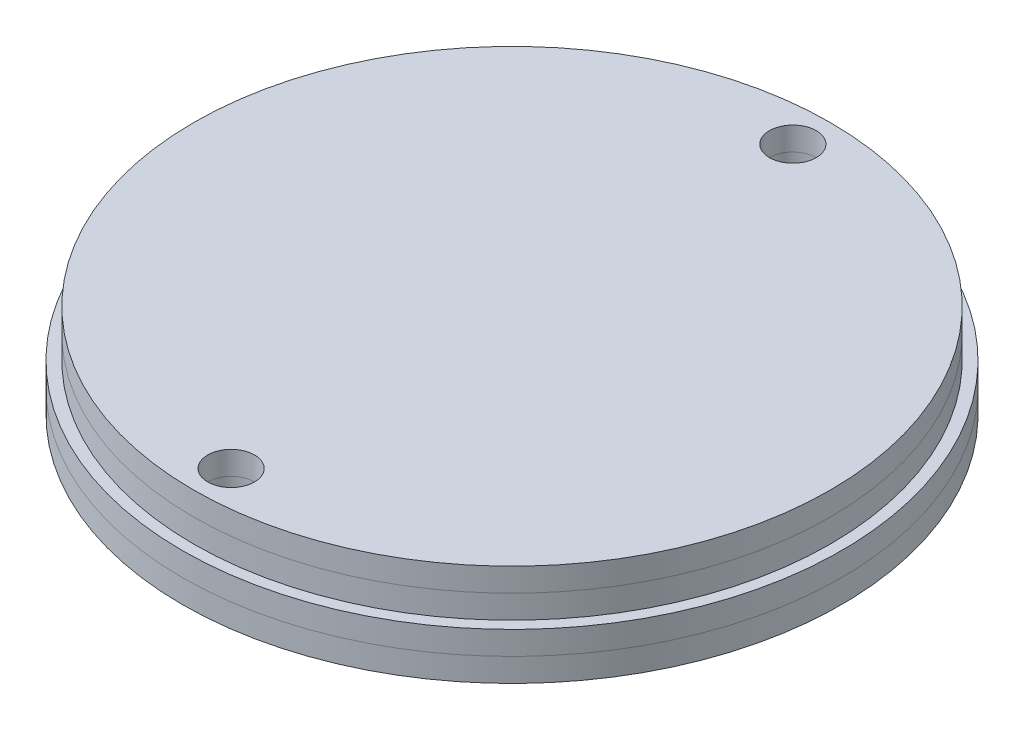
ISO-10303-21;
HEADER;
FILE_DESCRIPTION(('STEP AP214'),'2;1');
FILE_NAME('part.step','',(''),(''),'','','');
FILE_SCHEMA(('AUTOMOTIVE_DESIGN { 1 0 10303 214 1 1 1 1 }'));
ENDSEC;
DATA;
#1=APPLICATION_CONTEXT('core data for automotive mechanical design processes');
#2=APPLICATION_PROTOCOL_DEFINITION('international standard','automotive_design',2000,#1);
#3=PRODUCT_CONTEXT('',#1,'mechanical');
#4=PRODUCT('Part','Part','',(#3));
#5=PRODUCT_RELATED_PRODUCT_CATEGORY('part','',(#4));
#6=PRODUCT_DEFINITION_FORMATION('','',#4);
#7=PRODUCT_DEFINITION_CONTEXT('part definition',#1,'design');
#8=PRODUCT_DEFINITION('design','',#6,#7);
#9=PRODUCT_DEFINITION_SHAPE('','',#8);
#10=(LENGTH_UNIT() NAMED_UNIT(*) SI_UNIT(.MILLI.,.METRE.));
#11=(NAMED_UNIT(*) PLANE_ANGLE_UNIT() SI_UNIT($,.RADIAN.));
#12=(NAMED_UNIT(*) SI_UNIT($,.STERADIAN.) SOLID_ANGLE_UNIT());
#13=UNCERTAINTY_MEASURE_WITH_UNIT(LENGTH_MEASURE(1.E-05),#10,'distance_accuracy_value','');
#14=(GEOMETRIC_REPRESENTATION_CONTEXT(3) GLOBAL_UNCERTAINTY_ASSIGNED_CONTEXT((#13)) GLOBAL_UNIT_ASSIGNED_CONTEXT((#10,
#11,#12)) REPRESENTATION_CONTEXT('',''));
#15=CARTESIAN_POINT('',(0.,0.,0.));
#16=DIRECTION('',(0.,0.,1.));
#17=DIRECTION('',(1.,0.,0.));
#18=AXIS2_PLACEMENT_3D('',#15,#16,#17);
#19=CARTESIAN_POINT('',(0.,-6.35,0.));
#20=DIRECTION('',(0.,1.,0.));
#21=DIRECTION('',(0.,0.,1.));
#22=AXIS2_PLACEMENT_3D('',#19,#20,#21);
#23=CYLINDRICAL_SURFACE('',#22,44.704);
#24=CARTESIAN_POINT('',(0.,-6.35,0.));
#25=DIRECTION('',(0.,-1.,0.));
#26=DIRECTION('',(0.,0.,-1.));
#27=AXIS2_PLACEMENT_3D('',#24,#25,#26);
#28=CIRCLE('',#27,44.704);
#29=CARTESIAN_POINT('',(0.,-6.35,-44.704));
#30=VERTEX_POINT('',#29);
#31=EDGE_CURVE('E11',#30,#30,#28,.T.);
#32=ORIENTED_EDGE('',*,*,#31,.F.);
#33=EDGE_LOOP('',(#32));
#34=FACE_BOUND('',#33,.T.);
#35=CARTESIAN_POINT('',(0.,-3.175,0.));
#36=DIRECTION('',(0.,-1.,0.));
#37=DIRECTION('',(0.,0.,-1.));
#38=AXIS2_PLACEMENT_3D('',#35,#36,#37);
#39=CIRCLE('',#38,44.704);
#40=CARTESIAN_POINT('',(0.,-3.175,-44.704));
#41=VERTEX_POINT('',#40);
#42=EDGE_CURVE('E59',#41,#41,#39,.T.);
#43=ORIENTED_EDGE('',*,*,#42,.T.);
#44=EDGE_LOOP('',(#43));
#45=FACE_BOUND('',#44,.T.);
#46=ADVANCED_FACE('F52',(#34,#45),#23,.T.);
#47=CARTESIAN_POINT('',(0.,-6.35,0.));
#48=DIRECTION('',(0.,-1.,0.));
#49=DIRECTION('',(0.,0.,-1.));
#50=AXIS2_PLACEMENT_3D('',#47,#48,#49);
#51=PLANE('',#50);
#52=CARTESIAN_POINT('',(0.,-6.35,38.1));
#53=DIRECTION('',(0.,-1.,0.));
#54=DIRECTION('',(0.,0.,-1.));
#55=AXIS2_PLACEMENT_3D('',#52,#53,#54);
#56=CIRCLE('',#55,3.175);
#57=CARTESIAN_POINT('',(0.,-6.35,34.925));
#58=VERTEX_POINT('',#57);
#59=EDGE_CURVE('E71',#58,#58,#56,.T.);
#60=ORIENTED_EDGE('',*,*,#59,.F.);
#61=EDGE_LOOP('',(#60));
#62=FACE_BOUND('',#61,.T.);
#63=CARTESIAN_POINT('',(0.,-6.35,-38.1));
#64=DIRECTION('',(0.,1.,0.));
#65=DIRECTION('',(0.,0.,1.));
#66=AXIS2_PLACEMENT_3D('',#63,#64,#65);
#67=CIRCLE('',#66,3.175);
#68=CARTESIAN_POINT('',(0.,-6.35,-34.925));
#69=VERTEX_POINT('',#68);
#70=EDGE_CURVE('E65',#69,#69,#67,.T.);
#71=ORIENTED_EDGE('',*,*,#70,.T.);
#72=EDGE_LOOP('',(#71));
#73=FACE_BOUND('',#72,.T.);
#74=ORIENTED_EDGE('',*,*,#31,.T.);
#75=EDGE_LOOP('',(#74));
#76=FACE_BOUND('',#75,.T.);
#77=ADVANCED_FACE('F78',(#62,#73,#76),#51,.T.);
#78=CARTESIAN_POINT('',(0.,-3.175,0.));
#79=DIRECTION('',(0.,-1.,0.));
#80=DIRECTION('',(0.,0.,-1.));
#81=AXIS2_PLACEMENT_3D('',#78,#79,#80);
#82=PLANE('',#81);
#83=CARTESIAN_POINT('',(0.,-3.175,38.1));
#84=DIRECTION('',(0.,1.,0.));
#85=DIRECTION('',(0.,0.,1.));
#86=AXIS2_PLACEMENT_3D('',#83,#84,#85);
#87=CIRCLE('',#86,3.175);
#88=CARTESIAN_POINT('',(0.,-3.175,41.275));
#89=VERTEX_POINT('',#88);
#90=EDGE_CURVE('E68',#89,#89,#87,.T.);
#91=ORIENTED_EDGE('',*,*,#90,.F.);
#92=EDGE_LOOP('',(#91));
#93=FACE_BOUND('',#92,.T.);
#94=CARTESIAN_POINT('',(0.,-3.175,-38.1));
#95=DIRECTION('',(0.,-1.,0.));
#96=DIRECTION('',(0.,0.,-1.));
#97=AXIS2_PLACEMENT_3D('',#94,#95,#96);
#98=CIRCLE('',#97,3.175);
#99=CARTESIAN_POINT('',(0.,-3.175,-41.275));
#100=VERTEX_POINT('',#99);
#101=EDGE_CURVE('E55',#100,#100,#98,.T.);
#102=ORIENTED_EDGE('',*,*,#101,.T.);
#103=EDGE_LOOP('',(#102));
#104=FACE_BOUND('',#103,.T.);
#105=ORIENTED_EDGE('',*,*,#42,.F.);
#106=EDGE_LOOP('',(#105));
#107=FACE_BOUND('',#106,.T.);
#108=ADVANCED_FACE('F81',(#93,#104,#107),#82,.F.);
#109=CARTESIAN_POINT('',(0.,-6.35,-38.1));
#110=DIRECTION('',(0.,1.,0.));
#111=DIRECTION('',(0.,0.,1.));
#112=AXIS2_PLACEMENT_3D('',#109,#110,#111);
#113=CYLINDRICAL_SURFACE('',#112,3.175);
#114=ORIENTED_EDGE('',*,*,#70,.F.);
#115=EDGE_LOOP('',(#114));
#116=FACE_BOUND('',#115,.T.);
#117=ORIENTED_EDGE('',*,*,#101,.F.);
#118=EDGE_LOOP('',(#117));
#119=FACE_BOUND('',#118,.T.);
#120=ADVANCED_FACE('F85',(#116,#119),#113,.F.);
#121=CARTESIAN_POINT('',(0.,-6.35,38.1));
#122=DIRECTION('',(0.,1.,0.));
#123=DIRECTION('',(0.,0.,-1.));
#124=AXIS2_PLACEMENT_3D('',#121,#122,#123);
#125=CYLINDRICAL_SURFACE('',#124,3.175);
#126=ORIENTED_EDGE('',*,*,#59,.T.);
#127=EDGE_LOOP('',(#126));
#128=FACE_BOUND('',#127,.T.);
#129=ORIENTED_EDGE('',*,*,#90,.T.);
#130=EDGE_LOOP('',(#129));
#131=FACE_BOUND('',#130,.T.);
#132=ADVANCED_FACE('F75',(#128,#131),#125,.F.);
#133=CLOSED_SHELL('',(#46,#77,#108,#120,#132));
#134=MANIFOLD_SOLID_BREP('B2',#133);
#135=CARTESIAN_POINT('',(0.,6.35,0.));
#136=DIRECTION('',(0.,-1.,0.));
#137=DIRECTION('',(0.,0.,-1.));
#138=AXIS2_PLACEMENT_3D('',#135,#136,#137);
#139=CYLINDRICAL_SURFACE('',#138,43.18);
#140=CARTESIAN_POINT('',(0.,6.35,0.));
#141=DIRECTION('',(0.,1.,0.));
#142=DIRECTION('',(0.,0.,1.));
#143=AXIS2_PLACEMENT_3D('',#140,#141,#142);
#144=CIRCLE('',#143,43.18);
#145=CARTESIAN_POINT('',(0.,6.35,43.18));
#146=VERTEX_POINT('',#145);
#147=EDGE_CURVE('E51',#146,#146,#144,.T.);
#148=ORIENTED_EDGE('',*,*,#147,.F.);
#149=EDGE_LOOP('',(#148));
#150=FACE_BOUND('',#149,.T.);
#151=CARTESIAN_POINT('',(0.,3.175,0.));
#152=DIRECTION('',(0.,1.,0.));
#153=DIRECTION('',(0.,0.,1.));
#154=AXIS2_PLACEMENT_3D('',#151,#152,#153);
#155=CIRCLE('',#154,43.18);
#156=CARTESIAN_POINT('',(0.,3.175,43.18));
#157=VERTEX_POINT('',#156);
#158=EDGE_CURVE('E159',#157,#157,#155,.T.);
#159=ORIENTED_EDGE('',*,*,#158,.T.);
#160=EDGE_LOOP('',(#159));
#161=FACE_BOUND('',#160,.T.);
#162=ADVANCED_FACE('F152',(#150,#161),#139,.T.);
#163=CARTESIAN_POINT('',(0.,6.35,0.));
#164=DIRECTION('',(0.,1.,0.));
#165=DIRECTION('',(0.,0.,1.));
#166=AXIS2_PLACEMENT_3D('',#163,#164,#165);
#167=PLANE('',#166);
#168=CARTESIAN_POINT('',(0.,6.35,38.1));
#169=DIRECTION('',(0.,-1.,0.));
#170=DIRECTION('',(0.,0.,-1.));
#171=AXIS2_PLACEMENT_3D('',#168,#169,#170);
#172=CIRCLE('',#171,3.175);
#173=CARTESIAN_POINT('',(0.,6.35,34.925));
#174=VERTEX_POINT('',#173);
#175=EDGE_CURVE('E171',#174,#174,#172,.T.);
#176=ORIENTED_EDGE('',*,*,#175,.T.);
#177=EDGE_LOOP('',(#176));
#178=FACE_BOUND('',#177,.T.);
#179=CARTESIAN_POINT('',(0.,6.35,-38.1));
#180=DIRECTION('',(0.,1.,0.));
#181=DIRECTION('',(0.,0.,1.));
#182=AXIS2_PLACEMENT_3D('',#179,#180,#181);
#183=CIRCLE('',#182,3.175);
#184=CARTESIAN_POINT('',(0.,6.35,-34.925));
#185=VERTEX_POINT('',#184);
#186=EDGE_CURVE('E165',#185,#185,#183,.T.);
#187=ORIENTED_EDGE('',*,*,#186,.F.);
#188=EDGE_LOOP('',(#187));
#189=FACE_BOUND('',#188,.T.);
#190=ORIENTED_EDGE('',*,*,#147,.T.);
#191=EDGE_LOOP('',(#190));
#192=FACE_BOUND('',#191,.T.);
#193=ADVANCED_FACE('F175',(#178,#189,#192),#167,.T.);
#194=CARTESIAN_POINT('',(0.,3.175,0.));
#195=DIRECTION('',(0.,1.,0.));
#196=DIRECTION('',(0.,0.,1.));
#197=AXIS2_PLACEMENT_3D('',#194,#195,#196);
#198=PLANE('',#197);
#199=CARTESIAN_POINT('',(0.,3.175,38.1));
#200=DIRECTION('',(0.,-1.,0.));
#201=DIRECTION('',(0.,0.,-1.));
#202=AXIS2_PLACEMENT_3D('',#199,#200,#201);
#203=CIRCLE('',#202,3.175);
#204=CARTESIAN_POINT('',(0.,3.175,34.925));
#205=VERTEX_POINT('',#204);
#206=EDGE_CURVE('E168',#205,#205,#203,.T.);
#207=ORIENTED_EDGE('',*,*,#206,.F.);
#208=EDGE_LOOP('',(#207));
#209=FACE_BOUND('',#208,.T.);
#210=CARTESIAN_POINT('',(0.,3.175,-38.1));
#211=DIRECTION('',(0.,1.,0.));
#212=DIRECTION('',(0.,0.,1.));
#213=AXIS2_PLACEMENT_3D('',#210,#211,#212);
#214=CIRCLE('',#213,3.175);
#215=CARTESIAN_POINT('',(0.,3.175,-34.925));
#216=VERTEX_POINT('',#215);
#217=EDGE_CURVE('E155',#216,#216,#214,.T.);
#218=ORIENTED_EDGE('',*,*,#217,.T.);
#219=EDGE_LOOP('',(#218));
#220=FACE_BOUND('',#219,.T.);
#221=ORIENTED_EDGE('',*,*,#158,.F.);
#222=EDGE_LOOP('',(#221));
#223=FACE_BOUND('',#222,.T.);
#224=ADVANCED_FACE('F185',(#209,#220,#223),#198,.F.);
#225=CARTESIAN_POINT('',(0.,-6.35,-38.1));
#226=DIRECTION('',(0.,1.,0.));
#227=DIRECTION('',(0.,0.,1.));
#228=AXIS2_PLACEMENT_3D('',#225,#226,#227);
#229=CYLINDRICAL_SURFACE('',#228,3.175);
#230=ORIENTED_EDGE('',*,*,#186,.T.);
#231=EDGE_LOOP('',(#230));
#232=FACE_BOUND('',#231,.T.);
#233=ORIENTED_EDGE('',*,*,#217,.F.);
#234=EDGE_LOOP('',(#233));
#235=FACE_BOUND('',#234,.T.);
#236=ADVANCED_FACE('F181',(#232,#235),#229,.F.);
#237=CARTESIAN_POINT('',(0.,-6.35,38.1));
#238=DIRECTION('',(0.,1.,0.));
#239=DIRECTION('',(0.,0.,-1.));
#240=AXIS2_PLACEMENT_3D('',#237,#238,#239);
#241=CYLINDRICAL_SURFACE('',#240,3.175);
#242=ORIENTED_EDGE('',*,*,#175,.F.);
#243=EDGE_LOOP('',(#242));
#244=FACE_BOUND('',#243,.T.);
#245=ORIENTED_EDGE('',*,*,#206,.T.);
#246=EDGE_LOOP('',(#245));
#247=FACE_BOUND('',#246,.T.);
#248=ADVANCED_FACE('F178',(#244,#247),#241,.F.);
#249=CLOSED_SHELL('',(#162,#193,#224,#236,#248));
#250=MANIFOLD_SOLID_BREP('B6',#249);
#251=CARTESIAN_POINT('',(0.,3.175,0.));
#252=DIRECTION('',(0.,-1.,0.));
#253=DIRECTION('',(0.,0.,-1.));
#254=AXIS2_PLACEMENT_3D('',#251,#252,#253);
#255=CYLINDRICAL_SURFACE('',#254,43.18);
#256=CARTESIAN_POINT('',(0.,3.175,0.));
#257=DIRECTION('',(0.,1.,0.));
#258=DIRECTION('',(0.,0.,1.));
#259=AXIS2_PLACEMENT_3D('',#256,#257,#258);
#260=CIRCLE('',#259,43.18);
#261=CARTESIAN_POINT('',(0.,3.175,43.18));
#262=VERTEX_POINT('',#261);
#263=EDGE_CURVE('E151',#262,#262,#260,.T.);
#264=ORIENTED_EDGE('',*,*,#263,.F.);
#265=EDGE_LOOP('',(#264));
#266=FACE_BOUND('',#265,.T.);
#267=CARTESIAN_POINT('',(0.,0.,0.));
#268=DIRECTION('',(0.,1.,0.));
#269=DIRECTION('',(0.,0.,1.));
#270=AXIS2_PLACEMENT_3D('',#267,#268,#269);
#271=CIRCLE('',#270,43.18);
#272=CARTESIAN_POINT('',(0.,0.,43.18));
#273=VERTEX_POINT('',#272);
#274=EDGE_CURVE('E253',#273,#273,#271,.T.);
#275=ORIENTED_EDGE('',*,*,#274,.T.);
#276=EDGE_LOOP('',(#275));
#277=FACE_BOUND('',#276,.T.);
#278=ADVANCED_FACE('F245',(#266,#277),#255,.T.);
#279=CARTESIAN_POINT('',(0.,3.175,0.));
#280=DIRECTION('',(0.,1.,0.));
#281=DIRECTION('',(0.,0.,1.));
#282=AXIS2_PLACEMENT_3D('',#279,#280,#281);
#283=PLANE('',#282);
#284=CARTESIAN_POINT('',(0.,3.175,38.1));
#285=DIRECTION('',(0.,-1.,0.));
#286=DIRECTION('',(0.,0.,-1.));
#287=AXIS2_PLACEMENT_3D('',#284,#285,#286);
#288=CIRCLE('',#287,3.175);
#289=CARTESIAN_POINT('',(0.,3.175,34.925));
#290=VERTEX_POINT('',#289);
#291=EDGE_CURVE('E276',#290,#290,#288,.T.);
#292=ORIENTED_EDGE('',*,*,#291,.T.);
#293=EDGE_LOOP('',(#292));
#294=FACE_BOUND('',#293,.T.);
#295=CARTESIAN_POINT('',(0.,3.175,-38.1));
#296=DIRECTION('',(0.,1.,0.));
#297=DIRECTION('',(0.,0.,1.));
#298=AXIS2_PLACEMENT_3D('',#295,#296,#297);
#299=CIRCLE('',#298,3.175);
#300=CARTESIAN_POINT('',(0.,3.175,-34.925));
#301=VERTEX_POINT('',#300);
#302=EDGE_CURVE('E265',#301,#301,#299,.T.);
#303=ORIENTED_EDGE('',*,*,#302,.F.);
#304=EDGE_LOOP('',(#303));
#305=FACE_BOUND('',#304,.T.);
#306=ORIENTED_EDGE('',*,*,#263,.T.);
#307=EDGE_LOOP('',(#306));
#308=FACE_BOUND('',#307,.T.);
#309=ADVANCED_FACE('F281',(#294,#305,#308),#283,.T.);
#310=CARTESIAN_POINT('',(0.,-3.175,0.));
#311=DIRECTION('',(0.,1.,0.));
#312=DIRECTION('',(0.,0.,1.));
#313=AXIS2_PLACEMENT_3D('',#310,#311,#312);
#314=CYLINDRICAL_SURFACE('',#313,44.704);
#315=CARTESIAN_POINT('',(0.,-3.175,0.));
#316=DIRECTION('',(0.,1.,0.));
#317=DIRECTION('',(0.,0.,1.));
#318=AXIS2_PLACEMENT_3D('',#315,#316,#317);
#319=CIRCLE('',#318,44.704);
#320=CARTESIAN_POINT('',(0.,-3.175,44.704));
#321=VERTEX_POINT('',#320);
#322=EDGE_CURVE('E259',#321,#321,#319,.T.);
#323=ORIENTED_EDGE('',*,*,#322,.T.);
#324=EDGE_LOOP('',(#323));
#325=FACE_BOUND('',#324,.T.);
#326=CARTESIAN_POINT('',(0.,0.,0.));
#327=DIRECTION('',(0.,1.,0.));
#328=DIRECTION('',(0.,0.,1.));
#329=AXIS2_PLACEMENT_3D('',#326,#327,#328);
#330=CIRCLE('',#329,44.704);
#331=CARTESIAN_POINT('',(0.,0.,44.704));
#332=VERTEX_POINT('',#331);
#333=EDGE_CURVE('E261',#332,#332,#330,.T.);
#334=ORIENTED_EDGE('',*,*,#333,.F.);
#335=EDGE_LOOP('',(#334));
#336=FACE_BOUND('',#335,.T.);
#337=ADVANCED_FACE('F295',(#325,#336),#314,.T.);
#338=CARTESIAN_POINT('',(0.,-3.175,0.));
#339=DIRECTION('',(0.,1.,0.));
#340=DIRECTION('',(0.,0.,1.));
#341=AXIS2_PLACEMENT_3D('',#338,#339,#340);
#342=PLANE('',#341);
#343=CARTESIAN_POINT('',(0.,-3.175,38.1));
#344=DIRECTION('',(0.,-1.,0.));
#345=DIRECTION('',(0.,0.,-1.));
#346=AXIS2_PLACEMENT_3D('',#343,#344,#345);
#347=CIRCLE('',#346,3.175);
#348=CARTESIAN_POINT('',(0.,-3.175,34.925));
#349=VERTEX_POINT('',#348);
#350=EDGE_CURVE('E272',#349,#349,#347,.T.);
#351=ORIENTED_EDGE('',*,*,#350,.F.);
#352=EDGE_LOOP('',(#351));
#353=FACE_BOUND('',#352,.T.);
#354=CARTESIAN_POINT('',(0.,-3.175,-38.1));
#355=DIRECTION('',(0.,1.,0.));
#356=DIRECTION('',(0.,0.,1.));
#357=AXIS2_PLACEMENT_3D('',#354,#355,#356);
#358=CIRCLE('',#357,3.175);
#359=CARTESIAN_POINT('',(0.,-3.175,-34.925));
#360=VERTEX_POINT('',#359);
#361=EDGE_CURVE('E248',#360,#360,#358,.T.);
#362=ORIENTED_EDGE('',*,*,#361,.T.);
#363=EDGE_LOOP('',(#362));
#364=FACE_BOUND('',#363,.T.);
#365=ORIENTED_EDGE('',*,*,#322,.F.);
#366=EDGE_LOOP('',(#365));
#367=FACE_BOUND('',#366,.T.);
#368=ADVANCED_FACE('F291',(#353,#364,#367),#342,.F.);
#369=CARTESIAN_POINT('',(0.,0.,0.));
#370=DIRECTION('',(0.,1.,0.));
#371=DIRECTION('',(0.,0.,1.));
#372=AXIS2_PLACEMENT_3D('',#369,#370,#371);
#373=PLANE('',#372);
#374=ORIENTED_EDGE('',*,*,#274,.F.);
#375=EDGE_LOOP('',(#374));
#376=FACE_BOUND('',#375,.T.);
#377=ORIENTED_EDGE('',*,*,#333,.T.);
#378=EDGE_LOOP('',(#377));
#379=FACE_BOUND('',#378,.T.);
#380=ADVANCED_FACE('F294',(#376,#379),#373,.T.);
#381=CARTESIAN_POINT('',(0.,-6.35,-38.1));
#382=DIRECTION('',(0.,1.,0.));
#383=DIRECTION('',(0.,0.,1.));
#384=AXIS2_PLACEMENT_3D('',#381,#382,#383);
#385=CYLINDRICAL_SURFACE('',#384,3.175);
#386=ORIENTED_EDGE('',*,*,#302,.T.);
#387=EDGE_LOOP('',(#386));
#388=FACE_BOUND('',#387,.T.);
#389=ORIENTED_EDGE('',*,*,#361,.F.);
#390=EDGE_LOOP('',(#389));
#391=FACE_BOUND('',#390,.T.);
#392=ADVANCED_FACE('F287',(#388,#391),#385,.F.);
#393=CARTESIAN_POINT('',(0.,-6.35,38.1));
#394=DIRECTION('',(0.,1.,0.));
#395=DIRECTION('',(0.,0.,-1.));
#396=AXIS2_PLACEMENT_3D('',#393,#394,#395);
#397=CYLINDRICAL_SURFACE('',#396,3.175);
#398=ORIENTED_EDGE('',*,*,#291,.F.);
#399=EDGE_LOOP('',(#398));
#400=FACE_BOUND('',#399,.T.);
#401=ORIENTED_EDGE('',*,*,#350,.T.);
#402=EDGE_LOOP('',(#401));
#403=FACE_BOUND('',#402,.T.);
#404=ADVANCED_FACE('F284',(#400,#403),#397,.F.);
#405=CLOSED_SHELL('',(#278,#309,#337,#368,#380,#392,#404));
#406=MANIFOLD_SOLID_BREP('B46',#405);
#407=ADVANCED_BREP_SHAPE_REPRESENTATION('',(#18,#134,#250,#406),#14);
#408=SHAPE_DEFINITION_REPRESENTATION(#9,#407);
ENDSEC;
END-ISO-10303-21;
